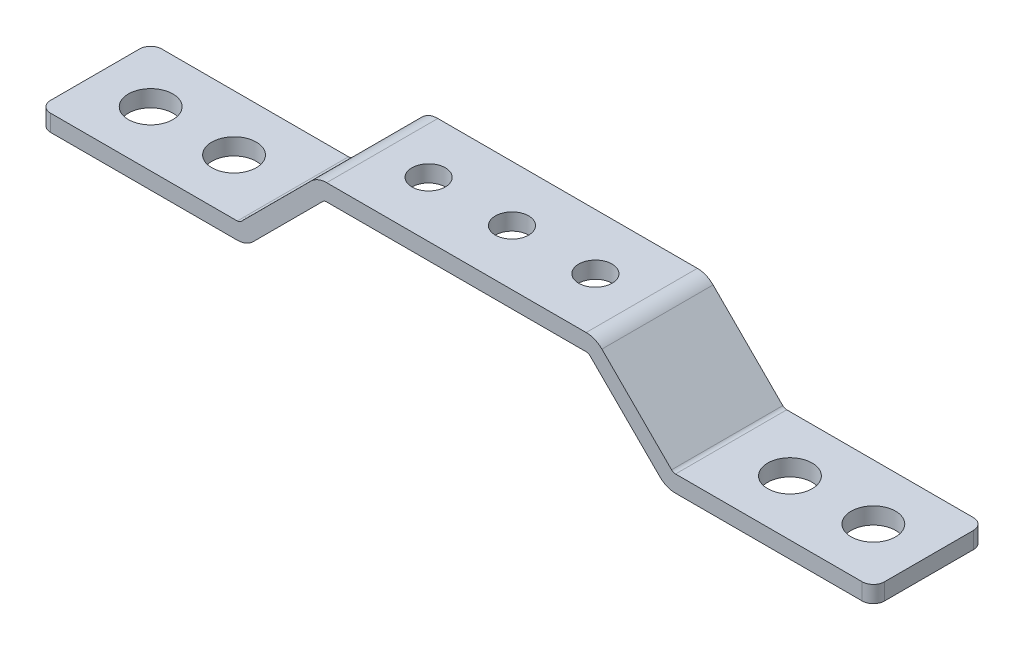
from build123d import *

# Parameters (mm, degrees)
BASE_EXTRUDE_THIN_DEPTH = 10
SKETCH2_R               = 3
CUT_EXTRUDE1_DEPTH      = 78.549983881
FILLET1_R               = 2
SKETCH4_R               = 4
CUT_EXTRUDE3_DEPTH      = 127.218115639


with BuildPart() as part:
    # Sketch1 → Base-Extrude-Thin (new, symmetric)
    with BuildSketch(Plane.XY):
        with BuildLine():
            Line((-75, -14), (-39.414213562, -14))
            ThreePointArc((-39.414213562, -14), (-39.03153013, -13.923879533), (-38.707106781, -13.707106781))
            Line((-38.707106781, -13.707106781), (-26.171572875, -1.171572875))
            ThreePointArc((-26.171572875, -1.171572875), (-24.87387948, -0.30448187), (-23.343145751, 0))
            Line((-23.343145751, 0), (23.343145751, 0))
            ThreePointArc((23.343145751, 0), (24.87387948, -0.30448187), (26.171572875, -1.171572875))
            Line((26.171572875, -1.171572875), (38.707106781, -13.707106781))
            ThreePointArc((38.707106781, -13.707106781), (39.03153013, -13.923879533), (39.414213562, -14))
            Line((39.414213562, -14), (75, -14))
            Line((75, -14), (75, -17))
            Line((75, -17), (39.414213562, -17))
            ThreePointArc((39.414213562, -17), (37.883479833, -16.69551813), (36.585786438, -15.828427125))
            Line((36.585786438, -15.828427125), (24.050252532, -3.292893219))
            ThreePointArc((24.050252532, -3.292893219), (23.725829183, -3.076120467), (23.343145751, -3))
            Line((23.343145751, -3), (-23.343145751, -3))
            ThreePointArc((-23.343145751, -3), (-23.725829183, -3.076120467), (-24.050252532, -3.292893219))
            Line((-24.050252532, -3.292893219), (-36.585786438, -15.828427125))
            ThreePointArc((-36.585786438, -15.828427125), (-37.883479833, -16.69551813), (-39.414213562, -17))
            Line((-39.414213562, -17), (-75, -17))
            Line((-75, -17), (-75, -14))
        make_face()
    extrude(amount=BASE_EXTRUDE_THIN_DEPTH, both=True)

    # Sketch2 → Cut-Extrude1 (cut, through all)
    with BuildSketch(Plane(origin=(0, 0, 0), x_dir=(-1, 0, 0), z_dir=(0, 1, 0))):
        with Locations(Location((0, 0, 0), (0, 0, 90))):
            Circle(SKETCH2_R)
        with Locations(Location((-15, 0, 0), (0, 0, 90))):
            Circle(SKETCH2_R)
        with Locations(Location((15, 0, 0), (0, 0, 270))):
            Circle(SKETCH2_R)
    extrude(amount=-CUT_EXTRUDE1_DEPTH, mode=Mode.SUBTRACT)

    # Fillet1
    fillet1_edges = [part.edges().sort_by_distance(p)[0] for p in [
        (75, -15.5, -10),
        (-75, -15.5, -10),
        (75, -15.5, 10),
        (-75, -15.5, 10),
    ]]
    fillet(fillet1_edges, radius=FILLET1_R)

    # Sketch4 → Cut-Extrude3 (cut, through all)
    with BuildSketch(Plane(origin=(-49.894977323, -14, 1.672932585), x_dir=(-1, 0, 0), z_dir=(0, 1, 0))):
        with Locations((0.105022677, -1.672932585)):
            Circle(SKETCH4_R)
        with Locations((15.105022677, -1.672932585)):
            Circle(SKETCH4_R)
    cut_extrude3 = extrude(amount=-CUT_EXTRUDE3_DEPTH, mode=Mode.SUBTRACT)

    # Mirror2: Cut-Extrude3 across Right Plane
    add(cut_extrude3.mirror(Plane(origin=(0, 0, 0), x_dir=(0, 0, -1), z_dir=(1, 0, 0))), mode=Mode.SUBTRACT)


solid = part.part
